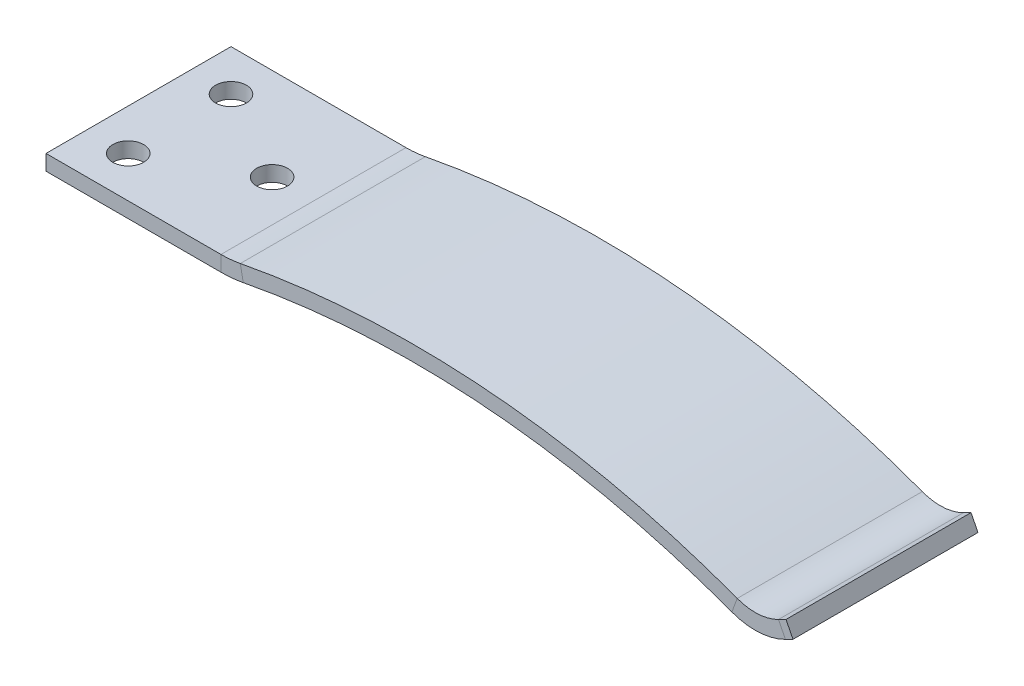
ISO-10303-21;
HEADER;
FILE_DESCRIPTION(('STEP AP214'),'2;1');
FILE_NAME('part.step','',(''),(''),'','','');
FILE_SCHEMA(('AUTOMOTIVE_DESIGN { 1 0 10303 214 1 1 1 1 }'));
ENDSEC;
DATA;
#1=APPLICATION_CONTEXT('core data for automotive mechanical design processes');
#2=APPLICATION_PROTOCOL_DEFINITION('international standard','automotive_design',2000,#1);
#3=PRODUCT_CONTEXT('',#1,'mechanical');
#4=PRODUCT('Part','Part','',(#3));
#5=PRODUCT_RELATED_PRODUCT_CATEGORY('part','',(#4));
#6=PRODUCT_DEFINITION_FORMATION('','',#4);
#7=PRODUCT_DEFINITION_CONTEXT('part definition',#1,'design');
#8=PRODUCT_DEFINITION('design','',#6,#7);
#9=PRODUCT_DEFINITION_SHAPE('','',#8);
#10=(LENGTH_UNIT() NAMED_UNIT(*) SI_UNIT(.MILLI.,.METRE.));
#11=(NAMED_UNIT(*) PLANE_ANGLE_UNIT() SI_UNIT($,.RADIAN.));
#12=(NAMED_UNIT(*) SI_UNIT($,.STERADIAN.) SOLID_ANGLE_UNIT());
#13=UNCERTAINTY_MEASURE_WITH_UNIT(LENGTH_MEASURE(1.E-05),#10,'distance_accuracy_value','');
#14=(GEOMETRIC_REPRESENTATION_CONTEXT(3) GLOBAL_UNCERTAINTY_ASSIGNED_CONTEXT((#13)) GLOBAL_UNIT_ASSIGNED_CONTEXT((#10,
#11,#12)) REPRESENTATION_CONTEXT('',''));
#15=CARTESIAN_POINT('',(0.,0.,0.));
#16=DIRECTION('',(0.,0.,1.));
#17=DIRECTION('',(1.,0.,0.));
#18=AXIS2_PLACEMENT_3D('',#15,#16,#17);
#19=CARTESIAN_POINT('',(17.0247986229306,-1.5,8.99999999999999));
#20=DIRECTION('',(0.,0.,0.999999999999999));
#21=DIRECTION('',(1.,0.,0.));
#22=AXIS2_PLACEMENT_3D('',#19,#20,#21);
#23=PLANE('',#22);
#24=DIRECTION('',(0.,0.999999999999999,0.));
#25=VECTOR('',#24,1.);
#26=CARTESIAN_POINT('',(17.0247986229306,-1.5,8.99999999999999));
#27=LINE('',#26,#25);
#28=CARTESIAN_POINT('',(17.0247986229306,-1.5,8.99999999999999));
#29=VERTEX_POINT('',#28);
#30=CARTESIAN_POINT('',(17.0247986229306,0.,8.99999999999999));
#31=VERTEX_POINT('',#30);
#32=EDGE_CURVE('E11',#29,#31,#27,.T.);
#33=ORIENTED_EDGE('',*,*,#32,.F.);
#34=CARTESIAN_POINT('',(17.0247986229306,9.99999999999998,8.99999999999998));
#35=DIRECTION('',(0.,0.,0.999999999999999));
#36=DIRECTION('',(1.,0.,0.));
#37=AXIS2_PLACEMENT_3D('',#34,#35,#36);
#38=CIRCLE('',#37,11.5);
#39=CARTESIAN_POINT('',(19.1901375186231,-1.29430420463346,8.99999999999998));
#40=VERTEX_POINT('',#39);
#41=EDGE_CURVE('E148',#29,#40,#38,.T.);
#42=ORIENTED_EDGE('',*,*,#41,.T.);
#43=DIRECTION('',(-0.188290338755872,0.982113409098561,0.));
#44=VECTOR('',#43,1.);
#45=CARTESIAN_POINT('',(19.1901375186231,-1.29430420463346,8.99999999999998));
#46=LINE('',#45,#44);
#47=CARTESIAN_POINT('',(18.9077020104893,0.178865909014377,8.99999999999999));
#48=VERTEX_POINT('',#47);
#49=EDGE_CURVE('E133',#40,#48,#46,.T.);
#50=ORIENTED_EDGE('',*,*,#49,.T.);
#51=CARTESIAN_POINT('',(17.0247986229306,9.99999999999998,8.99999999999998));
#52=DIRECTION('',(0.,0.,0.999999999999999));
#53=DIRECTION('',(-1.,0.,0.));
#54=AXIS2_PLACEMENT_3D('',#51,#52,#53);
#55=CIRCLE('',#54,9.99999999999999);
#56=EDGE_CURVE('E265',#31,#48,#55,.T.);
#57=ORIENTED_EDGE('',*,*,#56,.F.);
#58=EDGE_LOOP('',(#33,#42,#50,#57));
#59=FACE_BOUND('',#58,.T.);
#60=ADVANCED_FACE('F34',(#59),#23,.T.);
#61=CARTESIAN_POINT('',(17.0247986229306,0.,-8.99999999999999));
#62=DIRECTION('',(0.,0.,-0.999999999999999));
#63=DIRECTION('',(-1.,0.,0.));
#64=AXIS2_PLACEMENT_3D('',#61,#62,#63);
#65=PLANE('',#64);
#66=DIRECTION('',(0.,-0.999999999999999,0.));
#67=VECTOR('',#66,1.);
#68=CARTESIAN_POINT('',(17.0247986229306,0.,-8.99999999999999));
#69=LINE('',#68,#67);
#70=CARTESIAN_POINT('',(17.0247986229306,0.,-8.99999999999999));
#71=VERTEX_POINT('',#70);
#72=CARTESIAN_POINT('',(17.0247986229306,-1.5,-8.99999999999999));
#73=VERTEX_POINT('',#72);
#74=EDGE_CURVE('E43',#71,#73,#69,.T.);
#75=ORIENTED_EDGE('',*,*,#74,.F.);
#76=CARTESIAN_POINT('',(17.0247986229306,9.99999999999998,-8.99999999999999));
#77=DIRECTION('',(0.,0.,0.999999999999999));
#78=DIRECTION('',(-1.,0.,0.));
#79=AXIS2_PLACEMENT_3D('',#76,#77,#78);
#80=CIRCLE('',#79,9.99999999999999);
#81=CARTESIAN_POINT('',(18.9077020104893,0.178865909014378,-8.99999999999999));
#82=VERTEX_POINT('',#81);
#83=EDGE_CURVE('E189',#71,#82,#80,.T.);
#84=ORIENTED_EDGE('',*,*,#83,.T.);
#85=DIRECTION('',(0.188290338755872,-0.982113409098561,0.));
#86=VECTOR('',#85,1.);
#87=CARTESIAN_POINT('',(18.9077020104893,0.178865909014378,-8.99999999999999));
#88=LINE('',#87,#86);
#89=CARTESIAN_POINT('',(19.1901375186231,-1.29430420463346,-8.99999999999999));
#90=VERTEX_POINT('',#89);
#91=EDGE_CURVE('E145',#82,#90,#88,.T.);
#92=ORIENTED_EDGE('',*,*,#91,.T.);
#93=CARTESIAN_POINT('',(17.0247986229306,9.99999999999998,-8.99999999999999));
#94=DIRECTION('',(0.,0.,0.999999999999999));
#95=DIRECTION('',(1.,0.,0.));
#96=AXIS2_PLACEMENT_3D('',#93,#94,#95);
#97=CIRCLE('',#96,11.5);
#98=EDGE_CURVE('E160',#73,#90,#97,.T.);
#99=ORIENTED_EDGE('',*,*,#98,.F.);
#100=EDGE_LOOP('',(#75,#84,#92,#99));
#101=FACE_BOUND('',#100,.T.);
#102=ADVANCED_FACE('F283',(#101),#65,.T.);
#103=CARTESIAN_POINT('',(19.1901375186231,-1.29430420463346,8.99999999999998));
#104=DIRECTION('',(0.,0.,0.999999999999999));
#105=DIRECTION('',(1.,0.,0.));
#106=AXIS2_PLACEMENT_3D('',#103,#104,#105);
#107=PLANE('',#106);
#108=ORIENTED_EDGE('',*,*,#49,.F.);
#109=CARTESIAN_POINT('',(35.8538324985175,-88.2113409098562,8.99999999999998));
#110=DIRECTION('',(0.,0.,0.999999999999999));
#111=DIRECTION('',(1.,0.,0.));
#112=AXIS2_PLACEMENT_3D('',#109,#110,#111);
#113=CIRCLE('',#112,88.5);
#114=CARTESIAN_POINT('',(66.732104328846,-5.27291598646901,8.99999999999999));
#115=VERTEX_POINT('',#114);
#116=EDGE_CURVE('E137',#40,#115,#113,.F.);
#117=ORIENTED_EDGE('',*,*,#116,.T.);
#118=DIRECTION('',(0.348907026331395,0.937157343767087,0.));
#119=VECTOR('',#118,1.);
#120=CARTESIAN_POINT('',(66.732104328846,-5.27291598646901,8.99999999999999));
#121=LINE('',#120,#119);
#122=CARTESIAN_POINT('',(67.2554648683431,-3.86717997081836,8.99999999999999));
#123=VERTEX_POINT('',#122);
#124=EDGE_CURVE('E232',#115,#123,#121,.T.);
#125=ORIENTED_EDGE('',*,*,#124,.T.);
#126=CARTESIAN_POINT('',(35.8538324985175,-88.2113409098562,8.99999999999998));
#127=DIRECTION('',(0.,0.,-0.999999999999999));
#128=DIRECTION('',(-1.,0.,0.));
#129=AXIS2_PLACEMENT_3D('',#126,#127,#128);
#130=CIRCLE('',#129,90.);
#131=EDGE_CURVE('E140',#48,#123,#130,.T.);
#132=ORIENTED_EDGE('',*,*,#131,.F.);
#133=EDGE_LOOP('',(#108,#117,#125,#132));
#134=FACE_BOUND('',#133,.T.);
#135=ADVANCED_FACE('F135',(#134),#107,.T.);
#136=CARTESIAN_POINT('',(18.9077020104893,0.178865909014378,-8.99999999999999));
#137=DIRECTION('',(0.,0.,-0.999999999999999));
#138=DIRECTION('',(-1.,0.,0.));
#139=AXIS2_PLACEMENT_3D('',#136,#137,#138);
#140=PLANE('',#139);
#141=ORIENTED_EDGE('',*,*,#91,.F.);
#142=CARTESIAN_POINT('',(35.8538324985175,-88.2113409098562,-8.99999999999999));
#143=DIRECTION('',(0.,0.,-0.999999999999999));
#144=DIRECTION('',(-1.,0.,0.));
#145=AXIS2_PLACEMENT_3D('',#142,#143,#144);
#146=CIRCLE('',#145,90.);
#147=CARTESIAN_POINT('',(67.2554648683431,-3.86717997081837,-8.99999999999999));
#148=VERTEX_POINT('',#147);
#149=EDGE_CURVE('E186',#82,#148,#146,.T.);
#150=ORIENTED_EDGE('',*,*,#149,.T.);
#151=DIRECTION('',(-0.348907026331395,-0.937157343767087,0.));
#152=VECTOR('',#151,1.);
#153=CARTESIAN_POINT('',(67.2554648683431,-3.86717997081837,-8.99999999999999));
#154=LINE('',#153,#152);
#155=CARTESIAN_POINT('',(66.732104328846,-5.27291598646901,-8.99999999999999));
#156=VERTEX_POINT('',#155);
#157=EDGE_CURVE('E93',#148,#156,#154,.T.);
#158=ORIENTED_EDGE('',*,*,#157,.T.);
#159=CARTESIAN_POINT('',(35.8538324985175,-88.2113409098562,-8.99999999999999));
#160=DIRECTION('',(0.,0.,0.999999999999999));
#161=DIRECTION('',(1.,0.,0.));
#162=AXIS2_PLACEMENT_3D('',#159,#160,#161);
#163=CIRCLE('',#162,88.5);
#164=EDGE_CURVE('E202',#90,#156,#163,.F.);
#165=ORIENTED_EDGE('',*,*,#164,.F.);
#166=EDGE_LOOP('',(#141,#150,#158,#165));
#167=FACE_BOUND('',#166,.T.);
#168=ADVANCED_FACE('F285',(#167),#140,.T.);
#169=CARTESIAN_POINT('',(71.2653738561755,-3.63875584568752,8.99999999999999));
#170=DIRECTION('',(0.,0.,0.999999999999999));
#171=DIRECTION('',(1.,0.,0.));
#172=AXIS2_PLACEMENT_3D('',#169,#170,#171);
#173=PLANE('',#172);
#174=DIRECTION('',(0.453074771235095,-0.891472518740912,0.));
#175=VECTOR('',#174,1.);
#176=CARTESIAN_POINT('',(71.2653738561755,-3.63875584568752,8.99999999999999));
#177=LINE('',#176,#175);
#178=CARTESIAN_POINT('',(71.2653738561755,-3.63875584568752,8.99999999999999));
#179=VERTEX_POINT('',#178);
#180=CARTESIAN_POINT('',(71.9449860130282,-4.9759646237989,8.99999999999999));
#181=VERTEX_POINT('',#180);
#182=EDGE_CURVE('E52',#179,#181,#177,.T.);
#183=ORIENTED_EDGE('',*,*,#182,.F.);
#184=CARTESIAN_POINT('',(69.,0.81860674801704,8.99999999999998));
#185=DIRECTION('',(0.,0.,0.999999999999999));
#186=DIRECTION('',(1.,0.,0.));
#187=AXIS2_PLACEMENT_3D('',#184,#185,#186);
#188=CIRCLE('',#187,4.99999999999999);
#189=EDGE_CURVE('E261',#123,#179,#188,.T.);
#190=ORIENTED_EDGE('',*,*,#189,.F.);
#191=ORIENTED_EDGE('',*,*,#124,.F.);
#192=CARTESIAN_POINT('',(69.,0.81860674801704,8.99999999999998));
#193=DIRECTION('',(0.,0.,0.999999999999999));
#194=DIRECTION('',(1.,0.,0.));
#195=AXIS2_PLACEMENT_3D('',#192,#193,#194);
#196=CIRCLE('',#195,6.49999999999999);
#197=EDGE_CURVE('E168',#115,#181,#196,.T.);
#198=ORIENTED_EDGE('',*,*,#197,.T.);
#199=EDGE_LOOP('',(#183,#190,#191,#198));
#200=FACE_BOUND('',#199,.T.);
#201=ADVANCED_FACE('F332',(#200),#173,.T.);
#202=CARTESIAN_POINT('',(66.732104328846,-5.27291598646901,8.99999999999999));
#203=DIRECTION('',(0.,0.,0.999999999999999));
#204=DIRECTION('',(1.,0.,0.));
#205=AXIS2_PLACEMENT_3D('',#202,#203,#204);
#206=PLANE('',#205);
#207=DIRECTION('',(0.891472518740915,0.45307477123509,0.));
#208=VECTOR('',#207,1.);
#209=CARTESIAN_POINT('',(71.2653738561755,-3.63875584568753,8.99999999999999));
#210=LINE('',#209,#208);
#211=CARTESIAN_POINT('',(72.,-3.26539540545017,8.99999999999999));
#212=VERTEX_POINT('',#211);
#213=EDGE_CURVE('E258',#179,#212,#210,.T.);
#214=ORIENTED_EDGE('',*,*,#213,.F.);
#215=ORIENTED_EDGE('',*,*,#182,.T.);
#216=DIRECTION('',(0.891472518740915,0.45307477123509,0.));
#217=VECTOR('',#216,1.);
#218=CARTESIAN_POINT('',(71.9449860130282,-4.9759646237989,8.99999999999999));
#219=LINE('',#218,#217);
#220=CARTESIAN_POINT('',(72.6796121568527,-4.60260418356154,8.99999999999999));
#221=VERTEX_POINT('',#220);
#222=EDGE_CURVE('E106',#181,#221,#219,.T.);
#223=ORIENTED_EDGE('',*,*,#222,.T.);
#224=DIRECTION('',(0.453074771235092,-0.891472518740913,0.));
#225=VECTOR('',#224,1.);
#226=CARTESIAN_POINT('',(72.,-3.26539540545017,8.99999999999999));
#227=LINE('',#226,#225);
#228=EDGE_CURVE('E255',#212,#221,#227,.T.);
#229=ORIENTED_EDGE('',*,*,#228,.F.);
#230=EDGE_LOOP('',(#214,#215,#223,#229));
#231=FACE_BOUND('',#230,.T.);
#232=ADVANCED_FACE('F310',(#231),#206,.T.);
#233=CARTESIAN_POINT('',(67.2554648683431,-3.86717997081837,-8.99999999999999));
#234=DIRECTION('',(0.,0.,-0.999999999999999));
#235=DIRECTION('',(-1.,0.,0.));
#236=AXIS2_PLACEMENT_3D('',#233,#234,#235);
#237=PLANE('',#236);
#238=ORIENTED_EDGE('',*,*,#157,.F.);
#239=CARTESIAN_POINT('',(69.,0.818606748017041,-8.99999999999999));
#240=DIRECTION('',(0.,0.,0.999999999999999));
#241=DIRECTION('',(1.,0.,0.));
#242=AXIS2_PLACEMENT_3D('',#239,#240,#241);
#243=CIRCLE('',#242,4.99999999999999);
#244=CARTESIAN_POINT('',(71.2653738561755,-3.63875584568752,-8.99999999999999));
#245=VERTEX_POINT('',#244);
#246=EDGE_CURVE('E184',#148,#245,#243,.T.);
#247=ORIENTED_EDGE('',*,*,#246,.T.);
#248=DIRECTION('',(-0.453074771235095,0.891472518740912,0.));
#249=VECTOR('',#248,1.);
#250=CARTESIAN_POINT('',(71.9449860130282,-4.9759646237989,-8.99999999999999));
#251=LINE('',#250,#249);
#252=CARTESIAN_POINT('',(71.9449860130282,-4.9759646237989,-8.99999999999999));
#253=VERTEX_POINT('',#252);
#254=EDGE_CURVE('E100',#253,#245,#251,.T.);
#255=ORIENTED_EDGE('',*,*,#254,.F.);
#256=CARTESIAN_POINT('',(69.,0.818606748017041,-8.99999999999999));
#257=DIRECTION('',(0.,0.,0.999999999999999));
#258=DIRECTION('',(1.,0.,0.));
#259=AXIS2_PLACEMENT_3D('',#256,#257,#258);
#260=CIRCLE('',#259,6.49999999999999);
#261=EDGE_CURVE('E204',#156,#253,#260,.T.);
#262=ORIENTED_EDGE('',*,*,#261,.F.);
#263=EDGE_LOOP('',(#238,#247,#255,#262));
#264=FACE_BOUND('',#263,.T.);
#265=ADVANCED_FACE('F298',(#264),#237,.T.);
#266=CARTESIAN_POINT('',(71.9449860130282,-4.9759646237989,-8.99999999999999));
#267=DIRECTION('',(0.,0.,-0.999999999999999));
#268=DIRECTION('',(-1.,0.,0.));
#269=AXIS2_PLACEMENT_3D('',#266,#267,#268);
#270=PLANE('',#269);
#271=DIRECTION('',(1.,0.,0.));
#272=VECTOR('',#271,1.);
#273=CARTESIAN_POINT('',(0.,0.,-8.99999999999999));
#274=LINE('',#273,#272);
#275=CARTESIAN_POINT('',(0.,0.,-8.99999999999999));
#276=VERTEX_POINT('',#275);
#277=EDGE_CURVE('E192',#276,#71,#274,.T.);
#278=ORIENTED_EDGE('',*,*,#277,.T.);
#279=ORIENTED_EDGE('',*,*,#74,.T.);
#280=DIRECTION('',(1.,0.,0.));
#281=VECTOR('',#280,1.);
#282=CARTESIAN_POINT('',(0.,-1.5,-8.99999999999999));
#283=LINE('',#282,#281);
#284=CARTESIAN_POINT('',(0.,-1.5,-8.99999999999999));
#285=VERTEX_POINT('',#284);
#286=EDGE_CURVE('E198',#285,#73,#283,.T.);
#287=ORIENTED_EDGE('',*,*,#286,.F.);
#288=DIRECTION('',(0.,0.999999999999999,0.));
#289=VECTOR('',#288,1.);
#290=CARTESIAN_POINT('',(0.,-1.5,-8.99999999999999));
#291=LINE('',#290,#289);
#292=EDGE_CURVE('E195',#285,#276,#291,.T.);
#293=ORIENTED_EDGE('',*,*,#292,.T.);
#294=EDGE_LOOP('',(#278,#279,#287,#293));
#295=FACE_BOUND('',#294,.T.);
#296=ADVANCED_FACE('F340',(#295),#270,.T.);
#297=CARTESIAN_POINT('',(71.9449860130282,-4.9759646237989,8.99999999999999));
#298=DIRECTION('',(-0.45307477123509,0.891472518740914,0.));
#299=DIRECTION('',(-0.891472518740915,-0.45307477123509,0.));
#300=AXIS2_PLACEMENT_3D('',#297,#298,#299);
#301=PLANE('',#300);
#302=DIRECTION('',(0.891472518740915,0.45307477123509,0.));
#303=VECTOR('',#302,1.);
#304=CARTESIAN_POINT('',(71.9449860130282,-4.9759646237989,-8.99999999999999));
#305=LINE('',#304,#303);
#306=CARTESIAN_POINT('',(72.6796121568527,-4.60260418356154,-8.99999999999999));
#307=VERTEX_POINT('',#306);
#308=EDGE_CURVE('E174',#253,#307,#305,.T.);
#309=ORIENTED_EDGE('',*,*,#308,.T.);
#310=DIRECTION('',(0.,0.,-0.999999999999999));
#311=VECTOR('',#310,1.);
#312=CARTESIAN_POINT('',(72.6796121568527,-4.60260418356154,8.99999999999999));
#313=LINE('',#312,#311);
#314=EDGE_CURVE('E228',#221,#307,#313,.T.);
#315=ORIENTED_EDGE('',*,*,#314,.F.);
#316=ORIENTED_EDGE('',*,*,#222,.F.);
#317=DIRECTION('',(0.,0.,-0.999999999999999));
#318=VECTOR('',#317,1.);
#319=CARTESIAN_POINT('',(71.9449860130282,-4.9759646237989,8.99999999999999));
#320=LINE('',#319,#318);
#321=EDGE_CURVE('E170',#181,#253,#320,.T.);
#322=ORIENTED_EDGE('',*,*,#321,.T.);
#323=EDGE_LOOP('',(#309,#315,#316,#322));
#324=FACE_BOUND('',#323,.T.);
#325=ADVANCED_FACE('F304',(#324),#301,.F.);
#326=CARTESIAN_POINT('',(72.,-3.26539540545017,8.99999999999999));
#327=DIRECTION('',(0.891472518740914,0.453074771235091,0.));
#328=DIRECTION('',(-0.453074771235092,0.891472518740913,0.));
#329=AXIS2_PLACEMENT_3D('',#326,#327,#328);
#330=PLANE('',#329);
#331=DIRECTION('',(0.453074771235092,-0.891472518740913,0.));
#332=VECTOR('',#331,1.);
#333=CARTESIAN_POINT('',(72.,-3.26539540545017,-8.99999999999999));
#334=LINE('',#333,#332);
#335=CARTESIAN_POINT('',(72.,-3.26539540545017,-8.99999999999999));
#336=VERTEX_POINT('',#335);
#337=EDGE_CURVE('E177',#336,#307,#334,.T.);
#338=ORIENTED_EDGE('',*,*,#337,.F.);
#339=DIRECTION('',(0.,0.,-0.999999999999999));
#340=VECTOR('',#339,1.);
#341=CARTESIAN_POINT('',(72.,-3.26539540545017,8.99999999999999));
#342=LINE('',#341,#340);
#343=EDGE_CURVE('E226',#212,#336,#342,.T.);
#344=ORIENTED_EDGE('',*,*,#343,.F.);
#345=ORIENTED_EDGE('',*,*,#228,.T.);
#346=ORIENTED_EDGE('',*,*,#314,.T.);
#347=EDGE_LOOP('',(#338,#344,#345,#346));
#348=FACE_BOUND('',#347,.T.);
#349=ADVANCED_FACE('F309',(#348),#330,.T.);
#350=CARTESIAN_POINT('',(71.2653738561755,-3.63875584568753,8.99999999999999));
#351=DIRECTION('',(-0.45307477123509,0.891472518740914,0.));
#352=DIRECTION('',(-0.891472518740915,-0.45307477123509,0.));
#353=AXIS2_PLACEMENT_3D('',#350,#351,#352);
#354=PLANE('',#353);
#355=DIRECTION('',(0.891472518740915,0.45307477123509,0.));
#356=VECTOR('',#355,1.);
#357=CARTESIAN_POINT('',(71.2653738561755,-3.63875584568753,-8.99999999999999));
#358=LINE('',#357,#356);
#359=EDGE_CURVE('E181',#245,#336,#358,.T.);
#360=ORIENTED_EDGE('',*,*,#359,.F.);
#361=DIRECTION('',(0.,0.,-0.999999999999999));
#362=VECTOR('',#361,1.);
#363=CARTESIAN_POINT('',(71.2653738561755,-3.63875584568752,8.99999999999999));
#364=LINE('',#363,#362);
#365=EDGE_CURVE('E223',#179,#245,#364,.T.);
#366=ORIENTED_EDGE('',*,*,#365,.F.);
#367=ORIENTED_EDGE('',*,*,#213,.T.);
#368=ORIENTED_EDGE('',*,*,#343,.T.);
#369=EDGE_LOOP('',(#360,#366,#367,#368));
#370=FACE_BOUND('',#369,.T.);
#371=ADVANCED_FACE('F312',(#370),#354,.T.);
#372=CARTESIAN_POINT('',(69.,0.81860674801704,8.99999999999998));
#373=DIRECTION('',(0.,0.,-0.999999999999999));
#374=DIRECTION('',(-1.,0.,0.));
#375=AXIS2_PLACEMENT_3D('',#372,#373,#374);
#376=CYLINDRICAL_SURFACE('',#375,4.99999999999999);
#377=ORIENTED_EDGE('',*,*,#246,.F.);
#378=DIRECTION('',(0.,0.,-0.999999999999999));
#379=VECTOR('',#378,1.);
#380=CARTESIAN_POINT('',(67.2554648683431,-3.86717997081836,8.99999999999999));
#381=LINE('',#380,#379);
#382=EDGE_CURVE('E220',#123,#148,#381,.T.);
#383=ORIENTED_EDGE('',*,*,#382,.F.);
#384=ORIENTED_EDGE('',*,*,#189,.T.);
#385=ORIENTED_EDGE('',*,*,#365,.T.);
#386=EDGE_LOOP('',(#377,#383,#384,#385));
#387=FACE_BOUND('',#386,.T.);
#388=ADVANCED_FACE('F295',(#387),#376,.F.);
#389=CARTESIAN_POINT('',(35.8538324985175,-88.2113409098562,8.99999999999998));
#390=DIRECTION('',(0.,0.,-0.999999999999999));
#391=DIRECTION('',(-1.,0.,0.));
#392=AXIS2_PLACEMENT_3D('',#389,#390,#391);
#393=CYLINDRICAL_SURFACE('',#392,90.);
#394=ORIENTED_EDGE('',*,*,#149,.F.);
#395=DIRECTION('',(0.,0.,-0.999999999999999));
#396=VECTOR('',#395,1.);
#397=CARTESIAN_POINT('',(18.9077020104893,0.178865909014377,8.99999999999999));
#398=LINE('',#397,#396);
#399=EDGE_CURVE('E217',#48,#82,#398,.T.);
#400=ORIENTED_EDGE('',*,*,#399,.F.);
#401=ORIENTED_EDGE('',*,*,#131,.T.);
#402=ORIENTED_EDGE('',*,*,#382,.T.);
#403=EDGE_LOOP('',(#394,#400,#401,#402));
#404=FACE_BOUND('',#403,.T.);
#405=ADVANCED_FACE('F290',(#404),#393,.T.);
#406=CARTESIAN_POINT('',(17.0247986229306,9.99999999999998,8.99999999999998));
#407=DIRECTION('',(0.,0.,-0.999999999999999));
#408=DIRECTION('',(-1.,0.,0.));
#409=AXIS2_PLACEMENT_3D('',#406,#407,#408);
#410=CYLINDRICAL_SURFACE('',#409,9.99999999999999);
#411=ORIENTED_EDGE('',*,*,#83,.F.);
#412=DIRECTION('',(0.,0.,-0.999999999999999));
#413=VECTOR('',#412,1.);
#414=CARTESIAN_POINT('',(17.0247986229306,0.,8.99999999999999));
#415=LINE('',#414,#413);
#416=EDGE_CURVE('E214',#31,#71,#415,.T.);
#417=ORIENTED_EDGE('',*,*,#416,.F.);
#418=ORIENTED_EDGE('',*,*,#56,.T.);
#419=ORIENTED_EDGE('',*,*,#399,.T.);
#420=EDGE_LOOP('',(#411,#417,#418,#419));
#421=FACE_BOUND('',#420,.T.);
#422=ADVANCED_FACE('F288',(#421),#410,.F.);
#423=CARTESIAN_POINT('',(0.,0.,8.99999999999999));
#424=DIRECTION('',(0.,0.999999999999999,0.));
#425=DIRECTION('',(0.,0.,0.999999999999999));
#426=AXIS2_PLACEMENT_3D('',#423,#424,#425);
#427=PLANE('',#426);
#428=CARTESIAN_POINT('',(4.,0.,4.99999999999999));
#429=DIRECTION('',(0.,0.999999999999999,0.));
#430=DIRECTION('',(0.,0.,0.999999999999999));
#431=AXIS2_PLACEMENT_3D('',#428,#429,#430);
#432=CIRCLE('',#431,1.5);
#433=CARTESIAN_POINT('',(4.,0.,6.49999999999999));
#434=VERTEX_POINT('',#433);
#435=EDGE_CURVE('E251',#434,#434,#432,.T.);
#436=ORIENTED_EDGE('',*,*,#435,.F.);
#437=EDGE_LOOP('',(#436));
#438=FACE_BOUND('',#437,.T.);
#439=CARTESIAN_POINT('',(4.,0.,-5.));
#440=DIRECTION('',(0.,0.999999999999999,0.));
#441=DIRECTION('',(0.,0.,-0.999999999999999));
#442=AXIS2_PLACEMENT_3D('',#439,#440,#441);
#443=CIRCLE('',#442,1.5);
#444=CARTESIAN_POINT('',(4.,0.,-3.5));
#445=VERTEX_POINT('',#444);
#446=EDGE_CURVE('E241',#445,#445,#443,.T.);
#447=ORIENTED_EDGE('',*,*,#446,.F.);
#448=EDGE_LOOP('',(#447));
#449=FACE_BOUND('',#448,.T.);
#450=CARTESIAN_POINT('',(13.,0.,0.));
#451=DIRECTION('',(0.,0.999999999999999,0.));
#452=DIRECTION('',(0.,0.,0.999999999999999));
#453=AXIS2_PLACEMENT_3D('',#450,#451,#452);
#454=CIRCLE('',#453,1.5);
#455=CARTESIAN_POINT('',(13.,0.,1.49999999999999));
#456=VERTEX_POINT('',#455);
#457=EDGE_CURVE('E238',#456,#456,#454,.T.);
#458=ORIENTED_EDGE('',*,*,#457,.F.);
#459=EDGE_LOOP('',(#458));
#460=FACE_BOUND('',#459,.T.);
#461=ORIENTED_EDGE('',*,*,#277,.F.);
#462=DIRECTION('',(0.,0.,-0.999999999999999));
#463=VECTOR('',#462,1.);
#464=CARTESIAN_POINT('',(0.,0.,8.99999999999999));
#465=LINE('',#464,#463);
#466=CARTESIAN_POINT('',(0.,0.,8.99999999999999));
#467=VERTEX_POINT('',#466);
#468=EDGE_CURVE('E212',#467,#276,#465,.T.);
#469=ORIENTED_EDGE('',*,*,#468,.F.);
#470=DIRECTION('',(1.,0.,0.));
#471=VECTOR('',#470,1.);
#472=CARTESIAN_POINT('',(0.,0.,8.99999999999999));
#473=LINE('',#472,#471);
#474=EDGE_CURVE('E267',#467,#31,#473,.T.);
#475=ORIENTED_EDGE('',*,*,#474,.T.);
#476=ORIENTED_EDGE('',*,*,#416,.T.);
#477=EDGE_LOOP('',(#461,#469,#475,#476));
#478=FACE_BOUND('',#477,.T.);
#479=ADVANCED_FACE('F384',(#438,#449,#460,#478),#427,.T.);
#480=CARTESIAN_POINT('',(0.,-1.5,8.99999999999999));
#481=DIRECTION('',(-1.,0.,0.));
#482=DIRECTION('',(0.,0.,0.999999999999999));
#483=AXIS2_PLACEMENT_3D('',#480,#481,#482);
#484=PLANE('',#483);
#485=ORIENTED_EDGE('',*,*,#292,.F.);
#486=DIRECTION('',(0.,0.,-0.999999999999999));
#487=VECTOR('',#486,1.);
#488=CARTESIAN_POINT('',(0.,-1.5,8.99999999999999));
#489=LINE('',#488,#487);
#490=CARTESIAN_POINT('',(0.,-1.5,8.99999999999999));
#491=VERTEX_POINT('',#490);
#492=EDGE_CURVE('E210',#491,#285,#489,.T.);
#493=ORIENTED_EDGE('',*,*,#492,.F.);
#494=DIRECTION('',(0.,0.999999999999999,0.));
#495=VECTOR('',#494,1.);
#496=CARTESIAN_POINT('',(0.,-1.5,8.99999999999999));
#497=LINE('',#496,#495);
#498=EDGE_CURVE('E270',#491,#467,#497,.T.);
#499=ORIENTED_EDGE('',*,*,#498,.T.);
#500=ORIENTED_EDGE('',*,*,#468,.T.);
#501=EDGE_LOOP('',(#485,#493,#499,#500));
#502=FACE_BOUND('',#501,.T.);
#503=ADVANCED_FACE('F394',(#502),#484,.T.);
#504=CARTESIAN_POINT('',(0.,-1.5,8.99999999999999));
#505=DIRECTION('',(0.,0.999999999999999,0.));
#506=DIRECTION('',(0.,0.,0.999999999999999));
#507=AXIS2_PLACEMENT_3D('',#504,#505,#506);
#508=PLANE('',#507);
#509=CARTESIAN_POINT('',(4.,-1.5,4.99999999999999));
#510=DIRECTION('',(0.,0.999999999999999,0.));
#511=DIRECTION('',(0.,0.,0.999999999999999));
#512=AXIS2_PLACEMENT_3D('',#509,#510,#511);
#513=CIRCLE('',#512,1.5);
#514=CARTESIAN_POINT('',(4.,-1.5,6.49999999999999));
#515=VERTEX_POINT('',#514);
#516=EDGE_CURVE('E37',#515,#515,#513,.T.);
#517=ORIENTED_EDGE('',*,*,#516,.T.);
#518=EDGE_LOOP('',(#517));
#519=FACE_BOUND('',#518,.T.);
#520=CARTESIAN_POINT('',(4.,-1.5,-5.));
#521=DIRECTION('',(0.,0.999999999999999,0.));
#522=DIRECTION('',(0.,0.,0.999999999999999));
#523=AXIS2_PLACEMENT_3D('',#520,#521,#522);
#524=CIRCLE('',#523,1.5);
#525=CARTESIAN_POINT('',(4.,-1.5,-3.5));
#526=VERTEX_POINT('',#525);
#527=EDGE_CURVE('E239',#526,#526,#524,.T.);
#528=ORIENTED_EDGE('',*,*,#527,.T.);
#529=EDGE_LOOP('',(#528));
#530=FACE_BOUND('',#529,.T.);
#531=CARTESIAN_POINT('',(13.,-1.5,0.));
#532=DIRECTION('',(0.,0.999999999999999,0.));
#533=DIRECTION('',(0.,0.,0.999999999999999));
#534=AXIS2_PLACEMENT_3D('',#531,#532,#533);
#535=CIRCLE('',#534,1.5);
#536=CARTESIAN_POINT('',(13.,-1.5,1.49999999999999));
#537=VERTEX_POINT('',#536);
#538=EDGE_CURVE('E178',#537,#537,#535,.T.);
#539=ORIENTED_EDGE('',*,*,#538,.T.);
#540=EDGE_LOOP('',(#539));
#541=FACE_BOUND('',#540,.T.);
#542=ORIENTED_EDGE('',*,*,#286,.T.);
#543=DIRECTION('',(0.,0.,-0.999999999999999));
#544=VECTOR('',#543,1.);
#545=CARTESIAN_POINT('',(17.0247986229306,-1.5,8.99999999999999));
#546=LINE('',#545,#544);
#547=EDGE_CURVE('E162',#29,#73,#546,.T.);
#548=ORIENTED_EDGE('',*,*,#547,.F.);
#549=DIRECTION('',(1.,0.,0.));
#550=VECTOR('',#549,1.);
#551=CARTESIAN_POINT('',(0.,-1.5,8.99999999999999));
#552=LINE('',#551,#550);
#553=EDGE_CURVE('E153',#491,#29,#552,.T.);
#554=ORIENTED_EDGE('',*,*,#553,.F.);
#555=ORIENTED_EDGE('',*,*,#492,.T.);
#556=EDGE_LOOP('',(#542,#548,#554,#555));
#557=FACE_BOUND('',#556,.T.);
#558=ADVANCED_FACE('F280',(#519,#530,#541,#557),#508,.F.);
#559=CARTESIAN_POINT('',(17.0247986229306,9.99999999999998,8.99999999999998));
#560=DIRECTION('',(0.,0.,-0.999999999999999));
#561=DIRECTION('',(-1.,0.,0.));
#562=AXIS2_PLACEMENT_3D('',#559,#560,#561);
#563=CYLINDRICAL_SURFACE('',#562,11.5);
#564=ORIENTED_EDGE('',*,*,#98,.T.);
#565=DIRECTION('',(0.,0.,-0.999999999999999));
#566=VECTOR('',#565,1.);
#567=CARTESIAN_POINT('',(19.1901375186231,-1.29430420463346,8.99999999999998));
#568=LINE('',#567,#566);
#569=EDGE_CURVE('E157',#40,#90,#568,.T.);
#570=ORIENTED_EDGE('',*,*,#569,.F.);
#571=ORIENTED_EDGE('',*,*,#41,.F.);
#572=ORIENTED_EDGE('',*,*,#547,.T.);
#573=EDGE_LOOP('',(#564,#570,#571,#572));
#574=FACE_BOUND('',#573,.T.);
#575=ADVANCED_FACE('F158',(#574),#563,.T.);
#576=CARTESIAN_POINT('',(35.8538324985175,-88.2113409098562,8.99999999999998));
#577=DIRECTION('',(0.,0.,-0.999999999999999));
#578=DIRECTION('',(-1.,0.,0.));
#579=AXIS2_PLACEMENT_3D('',#576,#577,#578);
#580=CYLINDRICAL_SURFACE('',#579,88.5);
#581=ORIENTED_EDGE('',*,*,#164,.T.);
#582=DIRECTION('',(0.,0.,-0.999999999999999));
#583=VECTOR('',#582,1.);
#584=CARTESIAN_POINT('',(66.732104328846,-5.27291598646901,8.99999999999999));
#585=LINE('',#584,#583);
#586=EDGE_CURVE('E163',#115,#156,#585,.T.);
#587=ORIENTED_EDGE('',*,*,#586,.F.);
#588=ORIENTED_EDGE('',*,*,#116,.F.);
#589=ORIENTED_EDGE('',*,*,#569,.T.);
#590=EDGE_LOOP('',(#581,#587,#588,#589));
#591=FACE_BOUND('',#590,.T.);
#592=ADVANCED_FACE('F165',(#591),#580,.F.);
#593=CARTESIAN_POINT('',(69.,0.81860674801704,8.99999999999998));
#594=DIRECTION('',(0.,0.,-0.999999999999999));
#595=DIRECTION('',(-1.,0.,0.));
#596=AXIS2_PLACEMENT_3D('',#593,#594,#595);
#597=CYLINDRICAL_SURFACE('',#596,6.49999999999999);
#598=ORIENTED_EDGE('',*,*,#261,.T.);
#599=ORIENTED_EDGE('',*,*,#321,.F.);
#600=ORIENTED_EDGE('',*,*,#197,.F.);
#601=ORIENTED_EDGE('',*,*,#586,.T.);
#602=EDGE_LOOP('',(#598,#599,#600,#601));
#603=FACE_BOUND('',#602,.T.);
#604=ADVANCED_FACE('F301',(#603),#597,.T.);
#605=CARTESIAN_POINT('',(69.,0.81860674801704,8.99999999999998));
#606=DIRECTION('',(0.,0.,0.999999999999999));
#607=DIRECTION('',(1.,0.,0.));
#608=AXIS2_PLACEMENT_3D('',#605,#606,#607);
#609=PLANE('',#608);
#610=ORIENTED_EDGE('',*,*,#553,.T.);
#611=ORIENTED_EDGE('',*,*,#32,.T.);
#612=ORIENTED_EDGE('',*,*,#474,.F.);
#613=ORIENTED_EDGE('',*,*,#498,.F.);
#614=EDGE_LOOP('',(#610,#611,#612,#613));
#615=FACE_BOUND('',#614,.T.);
#616=ADVANCED_FACE('F276',(#615),#609,.T.);
#617=CARTESIAN_POINT('',(69.,0.818606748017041,-8.99999999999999));
#618=DIRECTION('',(0.,0.,0.999999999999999));
#619=DIRECTION('',(1.,0.,0.));
#620=AXIS2_PLACEMENT_3D('',#617,#618,#619);
#621=PLANE('',#620);
#622=ORIENTED_EDGE('',*,*,#308,.F.);
#623=ORIENTED_EDGE('',*,*,#254,.T.);
#624=ORIENTED_EDGE('',*,*,#359,.T.);
#625=ORIENTED_EDGE('',*,*,#337,.T.);
#626=EDGE_LOOP('',(#622,#623,#624,#625));
#627=FACE_BOUND('',#626,.T.);
#628=ADVANCED_FACE('F306',(#627),#621,.F.);
#629=CARTESIAN_POINT('',(13.,-5.68139325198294,0.));
#630=DIRECTION('',(0.,0.999999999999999,0.));
#631=DIRECTION('',(0.,0.,0.999999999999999));
#632=AXIS2_PLACEMENT_3D('',#629,#630,#631);
#633=CYLINDRICAL_SURFACE('',#632,1.5);
#634=CARTESIAN_POINT('',(13.,0.,1.49999999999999));
#635=CARTESIAN_POINT('',(13.,-0.015625,1.49999999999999));
#636=CARTESIAN_POINT('',(13.,-0.03125,1.49999999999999));
#637=CARTESIAN_POINT('',(13.,-0.0625000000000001,1.49999999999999));
#638=CARTESIAN_POINT('',(13.,-0.0781250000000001,1.49999999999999));
#639=CARTESIAN_POINT('',(13.,-0.109375,1.49999999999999));
#640=CARTESIAN_POINT('',(13.,-0.125,1.49999999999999));
#641=CARTESIAN_POINT('',(13.,-0.15625,1.49999999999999));
#642=CARTESIAN_POINT('',(13.,-0.171875,1.49999999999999));
#643=CARTESIAN_POINT('',(13.,-0.203125,1.49999999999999));
#644=CARTESIAN_POINT('',(13.,-0.21875,1.49999999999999));
#645=CARTESIAN_POINT('',(13.,-0.25,1.49999999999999));
#646=CARTESIAN_POINT('',(13.,-0.265625,1.49999999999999));
#647=CARTESIAN_POINT('',(13.,-0.296875,1.49999999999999));
#648=CARTESIAN_POINT('',(13.,-0.3125,1.49999999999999));
#649=CARTESIAN_POINT('',(13.,-0.34375,1.49999999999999));
#650=CARTESIAN_POINT('',(13.,-0.359375,1.49999999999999));
#651=CARTESIAN_POINT('',(13.,-0.390625,1.49999999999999));
#652=CARTESIAN_POINT('',(13.,-0.40625,1.49999999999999));
#653=CARTESIAN_POINT('',(13.,-0.4375,1.49999999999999));
#654=CARTESIAN_POINT('',(13.,-0.453125,1.49999999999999));
#655=CARTESIAN_POINT('',(13.,-0.484375,1.49999999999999));
#656=CARTESIAN_POINT('',(13.,-0.5,1.49999999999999));
#657=CARTESIAN_POINT('',(13.,-0.53125,1.49999999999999));
#658=CARTESIAN_POINT('',(13.,-0.546875,1.49999999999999));
#659=CARTESIAN_POINT('',(13.,-0.578125,1.49999999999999));
#660=CARTESIAN_POINT('',(13.,-0.59375,1.49999999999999));
#661=CARTESIAN_POINT('',(13.,-0.625,1.49999999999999));
#662=CARTESIAN_POINT('',(13.,-0.640625,1.49999999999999));
#663=CARTESIAN_POINT('',(13.,-0.671875,1.49999999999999));
#664=CARTESIAN_POINT('',(13.,-0.6875,1.49999999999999));
#665=CARTESIAN_POINT('',(13.,-0.71875,1.49999999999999));
#666=CARTESIAN_POINT('',(13.,-0.734375,1.49999999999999));
#667=CARTESIAN_POINT('',(13.,-0.765625,1.49999999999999));
#668=CARTESIAN_POINT('',(13.,-0.78125,1.49999999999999));
#669=CARTESIAN_POINT('',(13.,-0.8125,1.49999999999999));
#670=CARTESIAN_POINT('',(13.,-0.828125,1.49999999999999));
#671=CARTESIAN_POINT('',(13.,-0.859375,1.49999999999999));
#672=CARTESIAN_POINT('',(13.,-0.875,1.49999999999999));
#673=CARTESIAN_POINT('',(13.,-0.90625,1.49999999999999));
#674=CARTESIAN_POINT('',(13.,-0.921875,1.49999999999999));
#675=CARTESIAN_POINT('',(13.,-0.953125,1.49999999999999));
#676=CARTESIAN_POINT('',(13.,-0.96875,1.49999999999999));
#677=CARTESIAN_POINT('',(13.,-1.,1.49999999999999));
#678=CARTESIAN_POINT('',(13.,-1.015625,1.49999999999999));
#679=CARTESIAN_POINT('',(13.,-1.046875,1.49999999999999));
#680=CARTESIAN_POINT('',(13.,-1.0625,1.49999999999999));
#681=CARTESIAN_POINT('',(13.,-1.09375,1.49999999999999));
#682=CARTESIAN_POINT('',(13.,-1.109375,1.49999999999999));
#683=CARTESIAN_POINT('',(13.,-1.140625,1.49999999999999));
#684=CARTESIAN_POINT('',(13.,-1.15625,1.49999999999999));
#685=CARTESIAN_POINT('',(13.,-1.1875,1.49999999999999));
#686=CARTESIAN_POINT('',(13.,-1.203125,1.49999999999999));
#687=CARTESIAN_POINT('',(13.,-1.234375,1.49999999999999));
#688=CARTESIAN_POINT('',(13.,-1.25,1.49999999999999));
#689=CARTESIAN_POINT('',(13.,-1.28125,1.49999999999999));
#690=CARTESIAN_POINT('',(13.,-1.296875,1.49999999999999));
#691=CARTESIAN_POINT('',(13.,-1.328125,1.49999999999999));
#692=CARTESIAN_POINT('',(13.,-1.34375,1.49999999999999));
#693=CARTESIAN_POINT('',(13.,-1.375,1.49999999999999));
#694=CARTESIAN_POINT('',(13.,-1.390625,1.49999999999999));
#695=CARTESIAN_POINT('',(13.,-1.421875,1.49999999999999));
#696=CARTESIAN_POINT('',(13.,-1.4375,1.49999999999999));
#697=CARTESIAN_POINT('',(13.,-1.46875,1.49999999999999));
#698=CARTESIAN_POINT('',(13.,-1.484375,1.49999999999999));
#699=CARTESIAN_POINT('',(13.,-1.5,1.49999999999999));
#700=B_SPLINE_CURVE_WITH_KNOTS('',3,(#634,#635,#636,#637,#638,#639,#640,#641,#642,#643,#644,
#645,#646,#647,#648,#649,#650,#651,#652,#653,#654,#655,#656,#657,#658,#659,#660,#661,#662,#663,
#664,#665,#666,#667,#668,#669,#670,#671,#672,#673,#674,#675,#676,#677,#678,#679,#680,#681,#682,
#683,#684,#685,#686,#687,#688,#689,#690,#691,#692,#693,#694,#695,#696,#697,#698,#699),
.UNSPECIFIED.,.F.,.F.,(4,2,2,2,2,2,2,2,2,2,2,2,2,2,2,2,2,2,2,2,2,2,2,2,2,2,2,2,2,2,2,2,4),(0.,
0.046875,0.0937500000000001,0.140625,0.1875,0.234375,0.28125,0.328125,0.375,0.421875,0.46875,
0.515625,0.5625,0.609375,0.65625,0.703125,0.75,0.796875,0.84375,0.890625,0.9375,0.984375,
1.03125,1.078125,1.125,1.171875,1.21875,1.265625,1.3125,1.359375,1.40625,1.453125,1.5),.UNSPECIFIED.);
#701=EDGE_CURVE('BSEAM461',#456,#537,#700,.T.);
#702=ORIENTED_EDGE('',*,*,#457,.T.);
#703=ORIENTED_EDGE('',*,*,#538,.F.);
#704=ORIENTED_EDGE('',*,*,#701,.T.);
#705=ORIENTED_EDGE('',*,*,#701,.F.);
#706=EDGE_LOOP('',(#702,#704,#703,#705));
#707=FACE_BOUND('',#706,.T.);
#708=ADVANCED_FACE('F461',(#707),#633,.F.);
#709=CARTESIAN_POINT('',(4.,-5.68139325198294,-5.));
#710=DIRECTION('',(0.,0.999999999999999,0.));
#711=DIRECTION('',(0.,0.,0.999999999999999));
#712=AXIS2_PLACEMENT_3D('',#709,#710,#711);
#713=CYLINDRICAL_SURFACE('',#712,1.5);
#714=CARTESIAN_POINT('',(4.,0.,-3.5));
#715=CARTESIAN_POINT('',(4.,-0.015625,-3.5));
#716=CARTESIAN_POINT('',(4.,-0.03125,-3.5));
#717=CARTESIAN_POINT('',(4.,-0.0625000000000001,-3.5));
#718=CARTESIAN_POINT('',(4.,-0.0781250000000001,-3.5));
#719=CARTESIAN_POINT('',(4.,-0.109375,-3.5));
#720=CARTESIAN_POINT('',(4.,-0.125,-3.5));
#721=CARTESIAN_POINT('',(4.,-0.15625,-3.5));
#722=CARTESIAN_POINT('',(4.,-0.171875,-3.5));
#723=CARTESIAN_POINT('',(4.,-0.203125,-3.5));
#724=CARTESIAN_POINT('',(4.,-0.21875,-3.5));
#725=CARTESIAN_POINT('',(4.,-0.249999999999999,-3.5));
#726=CARTESIAN_POINT('',(4.,-0.265624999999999,-3.5));
#727=CARTESIAN_POINT('',(4.,-0.296874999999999,-3.5));
#728=CARTESIAN_POINT('',(4.,-0.312499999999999,-3.5));
#729=CARTESIAN_POINT('',(4.,-0.343749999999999,-3.5));
#730=CARTESIAN_POINT('',(4.,-0.359374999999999,-3.5));
#731=CARTESIAN_POINT('',(4.,-0.390625,-3.5));
#732=CARTESIAN_POINT('',(4.,-0.40625,-3.5));
#733=CARTESIAN_POINT('',(4.,-0.4375,-3.5));
#734=CARTESIAN_POINT('',(4.,-0.453125,-3.5));
#735=CARTESIAN_POINT('',(4.,-0.484375,-3.5));
#736=CARTESIAN_POINT('',(4.,-0.5,-3.5));
#737=CARTESIAN_POINT('',(4.,-0.531249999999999,-3.5));
#738=CARTESIAN_POINT('',(4.,-0.546874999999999,-3.5));
#739=CARTESIAN_POINT('',(4.,-0.578124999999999,-3.5));
#740=CARTESIAN_POINT('',(4.,-0.593749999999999,-3.5));
#741=CARTESIAN_POINT('',(4.,-0.624999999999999,-3.5));
#742=CARTESIAN_POINT('',(4.,-0.640624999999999,-3.5));
#743=CARTESIAN_POINT('',(4.,-0.671874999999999,-3.5));
#744=CARTESIAN_POINT('',(4.,-0.687499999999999,-3.5));
#745=CARTESIAN_POINT('',(4.,-0.718749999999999,-3.5));
#746=CARTESIAN_POINT('',(4.,-0.734374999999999,-3.5));
#747=CARTESIAN_POINT('',(4.,-0.765624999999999,-3.5));
#748=CARTESIAN_POINT('',(4.,-0.781249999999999,-3.5));
#749=CARTESIAN_POINT('',(4.,-0.812499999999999,-3.5));
#750=CARTESIAN_POINT('',(4.,-0.828124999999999,-3.5));
#751=CARTESIAN_POINT('',(4.,-0.859374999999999,-3.5));
#752=CARTESIAN_POINT('',(4.,-0.874999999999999,-3.5));
#753=CARTESIAN_POINT('',(4.,-0.906249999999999,-3.5));
#754=CARTESIAN_POINT('',(4.,-0.921874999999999,-3.5));
#755=CARTESIAN_POINT('',(4.,-0.953124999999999,-3.5));
#756=CARTESIAN_POINT('',(4.,-0.968749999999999,-3.5));
#757=CARTESIAN_POINT('',(4.,-0.999999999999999,-3.5));
#758=CARTESIAN_POINT('',(4.,-1.015625,-3.5));
#759=CARTESIAN_POINT('',(4.,-1.046875,-3.5));
#760=CARTESIAN_POINT('',(4.,-1.0625,-3.5));
#761=CARTESIAN_POINT('',(4.,-1.09375,-3.5));
#762=CARTESIAN_POINT('',(4.,-1.109375,-3.5));
#763=CARTESIAN_POINT('',(4.,-1.140625,-3.5));
#764=CARTESIAN_POINT('',(4.,-1.15625,-3.5));
#765=CARTESIAN_POINT('',(4.,-1.1875,-3.5));
#766=CARTESIAN_POINT('',(4.,-1.203125,-3.5));
#767=CARTESIAN_POINT('',(4.,-1.234375,-3.5));
#768=CARTESIAN_POINT('',(4.,-1.25,-3.5));
#769=CARTESIAN_POINT('',(4.,-1.28125,-3.5));
#770=CARTESIAN_POINT('',(4.,-1.296875,-3.5));
#771=CARTESIAN_POINT('',(4.,-1.328125,-3.5));
#772=CARTESIAN_POINT('',(4.,-1.34375,-3.5));
#773=CARTESIAN_POINT('',(4.,-1.375,-3.5));
#774=CARTESIAN_POINT('',(4.,-1.390625,-3.5));
#775=CARTESIAN_POINT('',(4.,-1.421875,-3.5));
#776=CARTESIAN_POINT('',(4.,-1.4375,-3.5));
#777=CARTESIAN_POINT('',(4.,-1.46875,-3.5));
#778=CARTESIAN_POINT('',(4.,-1.484375,-3.5));
#779=CARTESIAN_POINT('',(4.,-1.5,-3.5));
#780=B_SPLINE_CURVE_WITH_KNOTS('',3,(#714,#715,#716,#717,#718,#719,#720,#721,#722,#723,#724,
#725,#726,#727,#728,#729,#730,#731,#732,#733,#734,#735,#736,#737,#738,#739,#740,#741,#742,#743,
#744,#745,#746,#747,#748,#749,#750,#751,#752,#753,#754,#755,#756,#757,#758,#759,#760,#761,#762,
#763,#764,#765,#766,#767,#768,#769,#770,#771,#772,#773,#774,#775,#776,#777,#778,#779),
.UNSPECIFIED.,.F.,.F.,(4,2,2,2,2,2,2,2,2,2,2,2,2,2,2,2,2,2,2,2,2,2,2,2,2,2,2,2,2,2,2,2,4),(0.,
0.046875,0.0937500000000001,0.140625,0.1875,0.234374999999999,0.281249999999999,
0.328124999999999,0.374999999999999,0.421875,0.46875,0.515625,0.562499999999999,
0.609374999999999,0.656249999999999,0.703124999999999,0.749999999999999,0.796874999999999,
0.843749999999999,0.890624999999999,0.937499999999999,0.984374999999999,1.03125,1.078125,1.125,
1.171875,1.21875,1.265625,1.3125,1.359375,1.40625,1.453125,1.5),.UNSPECIFIED.);
#781=EDGE_CURVE('BSEAM471',#445,#526,#780,.T.);
#782=ORIENTED_EDGE('',*,*,#446,.T.);
#783=ORIENTED_EDGE('',*,*,#527,.F.);
#784=ORIENTED_EDGE('',*,*,#781,.T.);
#785=ORIENTED_EDGE('',*,*,#781,.F.);
#786=EDGE_LOOP('',(#782,#784,#783,#785));
#787=FACE_BOUND('',#786,.T.);
#788=ADVANCED_FACE('F471',(#787),#713,.F.);
#789=CARTESIAN_POINT('',(4.,-5.68139325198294,4.99999999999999));
#790=DIRECTION('',(0.,0.999999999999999,0.));
#791=DIRECTION('',(0.,0.,0.999999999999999));
#792=AXIS2_PLACEMENT_3D('',#789,#790,#791);
#793=CYLINDRICAL_SURFACE('',#792,1.5);
#794=CARTESIAN_POINT('',(4.,0.,6.49999999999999));
#795=CARTESIAN_POINT('',(4.,-0.0156249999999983,6.49999999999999));
#796=CARTESIAN_POINT('',(4.,-0.0312499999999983,6.49999999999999));
#797=CARTESIAN_POINT('',(4.,-0.0624999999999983,6.49999999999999));
#798=CARTESIAN_POINT('',(4.,-0.0781249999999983,6.49999999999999));
#799=CARTESIAN_POINT('',(4.,-0.109374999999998,6.49999999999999));
#800=CARTESIAN_POINT('',(4.,-0.124999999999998,6.49999999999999));
#801=CARTESIAN_POINT('',(4.,-0.156249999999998,6.49999999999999));
#802=CARTESIAN_POINT('',(4.,-0.171874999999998,6.49999999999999));
#803=CARTESIAN_POINT('',(4.,-0.203124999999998,6.49999999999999));
#804=CARTESIAN_POINT('',(4.,-0.218749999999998,6.49999999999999));
#805=CARTESIAN_POINT('',(4.,-0.249999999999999,6.49999999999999));
#806=CARTESIAN_POINT('',(4.,-0.265624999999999,6.49999999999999));
#807=CARTESIAN_POINT('',(4.,-0.296874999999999,6.49999999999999));
#808=CARTESIAN_POINT('',(4.,-0.312499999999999,6.49999999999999));
#809=CARTESIAN_POINT('',(4.,-0.343749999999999,6.49999999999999));
#810=CARTESIAN_POINT('',(4.,-0.359374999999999,6.49999999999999));
#811=CARTESIAN_POINT('',(4.,-0.390624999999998,6.49999999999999));
#812=CARTESIAN_POINT('',(4.,-0.406249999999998,6.49999999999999));
#813=CARTESIAN_POINT('',(4.,-0.437499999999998,6.49999999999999));
#814=CARTESIAN_POINT('',(4.,-0.453124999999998,6.49999999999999));
#815=CARTESIAN_POINT('',(4.,-0.484374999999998,6.49999999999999));
#816=CARTESIAN_POINT('',(4.,-0.499999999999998,6.49999999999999));
#817=CARTESIAN_POINT('',(4.,-0.531249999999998,6.49999999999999));
#818=CARTESIAN_POINT('',(4.,-0.546874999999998,6.49999999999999));
#819=CARTESIAN_POINT('',(4.,-0.578124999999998,6.49999999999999));
#820=CARTESIAN_POINT('',(4.,-0.593749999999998,6.49999999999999));
#821=CARTESIAN_POINT('',(4.,-0.624999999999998,6.49999999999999));
#822=CARTESIAN_POINT('',(4.,-0.640624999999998,6.49999999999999));
#823=CARTESIAN_POINT('',(4.,-0.671874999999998,6.49999999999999));
#824=CARTESIAN_POINT('',(4.,-0.687499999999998,6.49999999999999));
#825=CARTESIAN_POINT('',(4.,-0.718749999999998,6.49999999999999));
#826=CARTESIAN_POINT('',(4.,-0.734374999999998,6.49999999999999));
#827=CARTESIAN_POINT('',(4.,-0.765624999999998,6.49999999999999));
#828=CARTESIAN_POINT('',(4.,-0.781249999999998,6.49999999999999));
#829=CARTESIAN_POINT('',(4.,-0.812499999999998,6.49999999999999));
#830=CARTESIAN_POINT('',(4.,-0.828124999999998,6.49999999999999));
#831=CARTESIAN_POINT('',(4.,-0.859374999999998,6.49999999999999));
#832=CARTESIAN_POINT('',(4.,-0.874999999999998,6.49999999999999));
#833=CARTESIAN_POINT('',(4.,-0.906249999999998,6.49999999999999));
#834=CARTESIAN_POINT('',(4.,-0.921874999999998,6.49999999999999));
#835=CARTESIAN_POINT('',(4.,-0.953124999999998,6.49999999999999));
#836=CARTESIAN_POINT('',(4.,-0.968749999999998,6.49999999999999));
#837=CARTESIAN_POINT('',(4.,-0.999999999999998,6.49999999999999));
#838=CARTESIAN_POINT('',(4.,-1.015625,6.49999999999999));
#839=CARTESIAN_POINT('',(4.,-1.046875,6.49999999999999));
#840=CARTESIAN_POINT('',(4.,-1.0625,6.49999999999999));
#841=CARTESIAN_POINT('',(4.,-1.09375,6.49999999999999));
#842=CARTESIAN_POINT('',(4.,-1.109375,6.49999999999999));
#843=CARTESIAN_POINT('',(4.,-1.140625,6.49999999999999));
#844=CARTESIAN_POINT('',(4.,-1.15625,6.49999999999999));
#845=CARTESIAN_POINT('',(4.,-1.1875,6.49999999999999));
#846=CARTESIAN_POINT('',(4.,-1.203125,6.49999999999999));
#847=CARTESIAN_POINT('',(4.,-1.234375,6.49999999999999));
#848=CARTESIAN_POINT('',(4.,-1.25,6.49999999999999));
#849=CARTESIAN_POINT('',(4.,-1.28125,6.49999999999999));
#850=CARTESIAN_POINT('',(4.,-1.296875,6.49999999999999));
#851=CARTESIAN_POINT('',(4.,-1.328125,6.49999999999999));
#852=CARTESIAN_POINT('',(4.,-1.34375,6.49999999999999));
#853=CARTESIAN_POINT('',(4.,-1.375,6.49999999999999));
#854=CARTESIAN_POINT('',(4.,-1.390625,6.49999999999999));
#855=CARTESIAN_POINT('',(4.,-1.421875,6.49999999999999));
#856=CARTESIAN_POINT('',(4.,-1.4375,6.49999999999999));
#857=CARTESIAN_POINT('',(4.,-1.46875,6.49999999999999));
#858=CARTESIAN_POINT('',(4.,-1.484375,6.49999999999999));
#859=CARTESIAN_POINT('',(4.,-1.5,6.49999999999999));
#860=B_SPLINE_CURVE_WITH_KNOTS('',3,(#794,#795,#796,#797,#798,#799,#800,#801,#802,#803,#804,
#805,#806,#807,#808,#809,#810,#811,#812,#813,#814,#815,#816,#817,#818,#819,#820,#821,#822,#823,
#824,#825,#826,#827,#828,#829,#830,#831,#832,#833,#834,#835,#836,#837,#838,#839,#840,#841,#842,
#843,#844,#845,#846,#847,#848,#849,#850,#851,#852,#853,#854,#855,#856,#857,#858,#859),
.UNSPECIFIED.,.F.,.F.,(4,2,2,2,2,2,2,2,2,2,2,2,2,2,2,2,2,2,2,2,2,2,2,2,2,2,2,2,2,2,2,2,4),(0.,
0.046875,0.0937500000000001,0.140625,0.1875,0.234375,0.28125,0.328125,0.375,0.421875,0.46875,
0.515625,0.5625,0.609375,0.65625,0.703125,0.75,0.796875,0.84375,0.890625,0.9375,0.984375,
1.03125,1.078125,1.125,1.171875,1.21875,1.265625,1.3125,1.359375,1.40625,1.453125,1.5),.UNSPECIFIED.);
#861=EDGE_CURVE('BSEAM482',#434,#515,#860,.T.);
#862=ORIENTED_EDGE('',*,*,#435,.T.);
#863=ORIENTED_EDGE('',*,*,#516,.F.);
#864=ORIENTED_EDGE('',*,*,#861,.T.);
#865=ORIENTED_EDGE('',*,*,#861,.F.);
#866=EDGE_LOOP('',(#862,#864,#863,#865));
#867=FACE_BOUND('',#866,.T.);
#868=ADVANCED_FACE('F482',(#867),#793,.F.);
#869=CLOSED_SHELL('',(#60,#102,#135,#168,#201,#232,#265,#296,#325,#349,#371,#388,#405,#422,#479,
#503,#558,#575,#592,#604,#616,#628,#708,#788,#868));
#870=MANIFOLD_SOLID_BREP('B2',#869);
#871=ADVANCED_BREP_SHAPE_REPRESENTATION('',(#18,#870),#14);
#872=SHAPE_DEFINITION_REPRESENTATION(#9,#871);
ENDSEC;
END-ISO-10303-21;
